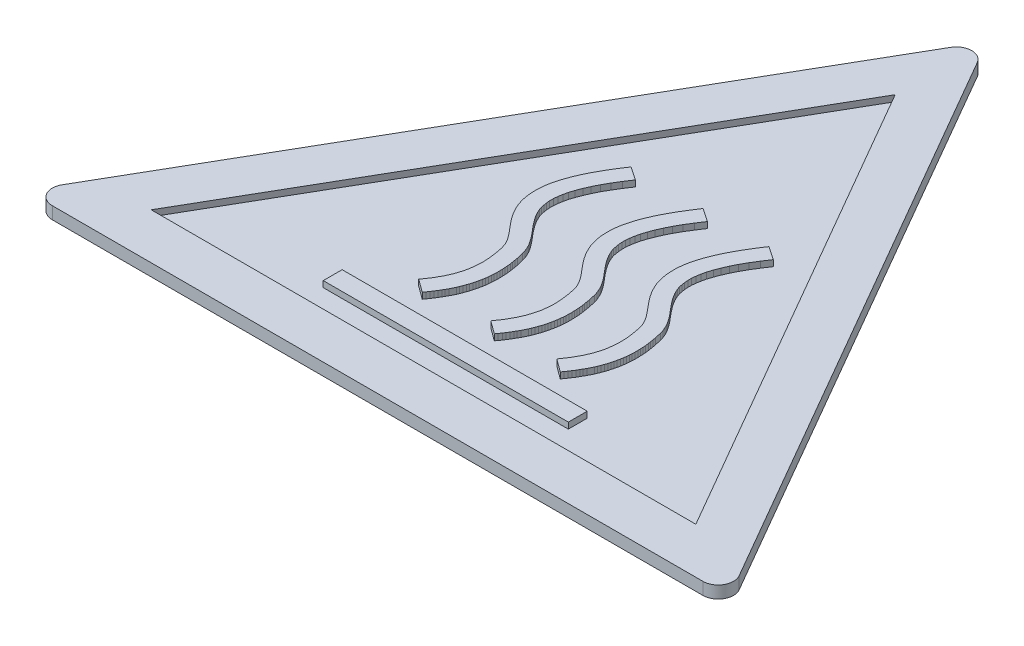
from build123d import *

# Parameters (mm, degrees)
SKIZZE1_W                       = 25
SKIZZE1_H                       = 25
LINEAR_AUSTRAGEN1_DEPTH         = 0.2
LINEAR_AUSTRAGEN_D_NN1_DEPTH    = 0.2
VERRUNDUNG1_R                   = 0.5
SKIZZE3_W                       = 8.01141993
SKIZZE3_H                       = 0.617561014
LINEAR_AUSTRAGEN2_DEPTH         = 0.2
SKIZZE4_OUTSIDE_W               = 34.072
SKIZZE4_OUTSIDE_H               = 34.072
SCHNITT_LINEAR_AUSTRAGEN1_DEPTH = 20.52972094


with BuildPart() as part:
    # Skizze1 → Linear austragen1 (new body)
    with BuildSketch(Plane(origin=(0, 0, 0), x_dir=(1, 0, 0), z_dir=(0, 1, 0))):
        with Locations((0, 2.5)):
            Rectangle(SKIZZE1_W, SKIZZE1_H)
    extrude(amount=LINEAR_AUSTRAGEN1_DEPTH)

    # Skizze2 → Linear-Austragen-D_nn1 (add)
    with BuildSketch(Plane(origin=(0, 0.2, 0), x_dir=(-1, 0, 0), z_dir=(0, 1, 0))):
        Polygon((11.5, 6.639528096), (0, -13.279056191), (-11.5, 6.639528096), align=None)
        Polygon((8.901923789, 5.139528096), (0, -10.279056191), (-8.901923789, 5.139528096), align=None, mode=Mode.SUBTRACT)
    extrude(amount=LINEAR_AUSTRAGEN_D_NN1_DEPTH)

    # Verrundung1
    verrundung1_edges = [part.edges().sort_by_distance(p)[0] for p in [
        (11.5, 0.3, 6.639528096),
        (0, 0.3, -13.279056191),
        (-11.5, 0.3, 6.639528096),
    ]]
    fillet(verrundung1_edges, radius=VERRUNDUNG1_R)

    # Skizze3 → Linear austragen2 (add)
    with BuildSketch(Plane(origin=(-0.935206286, 0.2, 1.03383953), x_dir=(1, 0, 0), z_dir=(0, 1, 0))):
        Polygon((-0.660127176, 0.718584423), (-0.69387368, 0.836697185), (-0.741118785, 0.948060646), (-0.79173854, 1.052674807), (-0.852482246, 1.150539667), (-0.916600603, 1.245029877), (-0.98409361, 1.336145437), (-1.051586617, 1.420511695), (-1.122454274, 1.504877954), (-1.189947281, 1.585869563), (-1.260814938, 1.670235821), (-1.321558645, 1.747852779), (-1.385677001, 1.832219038), (-1.443046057, 1.909835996), (-1.497040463, 1.994202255), (-1.547660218, 2.078568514), (-1.591530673, 2.166309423), (-1.632026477, 2.257424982), (-1.66239833, 2.345165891), (-1.682646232, 2.446405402), (-1.699519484, 2.551019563), (-1.709643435, 2.665757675), (-1.709643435, 2.787245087), (-1.696144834, 2.9154818), (-1.672522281, 3.057217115), (-1.638775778, 3.209076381), (-1.584781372, 3.374434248), (-1.517288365, 3.553290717), (-1.432922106, 3.745645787), (-1.331682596, 3.951499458), (-1.210195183, 4.16747708), (-1.065085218, 4.403702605), (-0.899727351, 4.653426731), (-1.338431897, 4.950395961), (-1.510539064, 4.687173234), (-1.66239833, 4.437449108), (-1.797384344, 4.194474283), (-1.912122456, 3.96837271), (-2.003238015, 3.755769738), (-2.084229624, 3.549916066), (-2.14497333, 3.350811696), (-2.192218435, 3.165205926), (-2.222590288, 2.982974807), (-2.23608889, 2.807492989), (-2.23608889, 2.645509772), (-2.225964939, 2.490275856), (-2.202342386, 2.345165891), (-2.168595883, 2.203430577), (-2.124725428, 2.068444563), (-2.070731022, 1.9435825), (-2.013361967, 1.828844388), (-1.94924361, 1.717480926), (-1.881750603, 1.612866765), (-1.810882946, 1.515001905), (-1.740015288, 1.423886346), (-1.66577298, 1.332770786), (-1.594905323, 1.248404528), (-1.527412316, 1.167412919), (-1.463293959, 1.089795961), (-1.402550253, 1.012179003), (-1.348555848, 0.941311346), (-1.297936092, 0.867069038), (-1.257440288, 0.796201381), (-1.220319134, 0.725333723), (-1.193321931, 0.661215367), (-1.173074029, 0.590347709), (-1.149451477, 0.5026068), (-1.132578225, 0.414865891), (-1.115704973, 0.330499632), (-1.102206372, 0.246133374), (-1.092082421, 0.165141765), (-1.08195847, 0.087524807), (-1.075209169, 0.009907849), (-1.071834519, -0.067709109), (-1.068459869, -0.148700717), (-1.068459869, -0.216193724), (-1.071834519, -0.287061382), (-1.07858382, -0.361303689), (-1.08533312, -0.435545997), (-1.095457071, -0.506413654), (-1.102206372, -0.570532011), (-1.115704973, -0.634650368), (-1.132578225, -0.702143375), (-1.149451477, -0.769636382), (-1.169699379, -0.833754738), (-1.193321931, -0.904622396), (-1.213569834, -0.972115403), (-1.240567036, -1.029484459), (-1.27093889, -1.096977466), (-1.297936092, -1.164470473), (-1.331682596, -1.225214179), (-1.36880375, -1.289332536), (-1.409299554, -1.363574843), (-1.446420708, -1.43106785), (-1.486916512, -1.491811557), (-1.534161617, -1.559304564), (-1.581406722, -1.630172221), (-1.628651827, -1.697665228), (-1.203445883, -2.00813306), (-1.149451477, -1.933890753), (-1.095457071, -1.856273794), (-1.048211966, -1.782031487), (-0.994217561, -1.701039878), (-0.950347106, -1.62004827), (-0.909851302, -1.552555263), (-0.865980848, -1.474938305), (-0.825485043, -1.393946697), (-0.784989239, -1.312955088), (-0.754617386, -1.23871278), (-0.720870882, -1.154346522), (-0.69387368, -1.073354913), (-0.663501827, -0.995737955), (-0.643253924, -0.911371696), (-0.619631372, -0.830380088), (-0.60275812, -0.74938848), (-0.582510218, -0.65827292), (-0.569011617, -0.573906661), (-0.558887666, -0.489540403), (-0.552138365, -0.401799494), (-0.545389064, -0.320807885), (-0.542014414, -0.229692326), (-0.542014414, -0.135202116), (-0.545389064, -0.047461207), (-0.548763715, 0.043654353), (-0.555513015, 0.134769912), (-0.565636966, 0.232634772), (-0.582510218, 0.327124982), (-0.59600882, 0.418240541), (-0.612882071, 0.516105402), (-0.636504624, 0.617344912), align=None)
        Polygon((1.695378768, 0.718584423), (1.661632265, 0.836697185), (1.61438716, 0.948060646), (1.563767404, 1.052674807), (1.503023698, 1.150539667), (1.438905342, 1.245029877), (1.371412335, 1.336145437), (1.303919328, 1.420511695), (1.23305167, 1.504877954), (1.165558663, 1.585869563), (1.094691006, 1.670235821), (1.0339473, 1.747852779), (0.969828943, 1.832219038), (0.912459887, 1.909835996), (0.858465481, 1.994202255), (0.807845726, 2.078568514), (0.763975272, 2.166309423), (0.723479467, 2.257424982), (0.693107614, 2.345165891), (0.672859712, 2.446405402), (0.65598646, 2.551019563), (0.645862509, 2.665757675), (0.645862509, 2.787245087), (0.659361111, 2.9154818), (0.682983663, 3.057217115), (0.716730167, 3.209076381), (0.770724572, 3.374434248), (0.838217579, 3.553290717), (0.922583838, 3.745645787), (1.023823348, 3.951499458), (1.145310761, 4.16747708), (1.290420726, 4.403702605), (1.455778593, 4.653426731), (1.017074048, 4.950395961), (0.84496688, 4.687173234), (0.693107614, 4.437449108), (0.5581216, 4.194474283), (0.443383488, 3.96837271), (0.352267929, 3.755769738), (0.27127632, 3.549916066), (0.210532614, 3.350811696), (0.163287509, 3.165205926), (0.132915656, 2.982974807), (0.119417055, 2.807492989), (0.119417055, 2.645509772), (0.129541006, 2.490275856), (0.153163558, 2.345165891), (0.186910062, 2.203430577), (0.230780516, 2.068444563), (0.284774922, 1.9435825), (0.342143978, 1.828844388), (0.406262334, 1.717480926), (0.473755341, 1.612866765), (0.544622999, 1.515001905), (0.615490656, 1.423886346), (0.689732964, 1.332770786), (0.760600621, 1.248404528), (0.828093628, 1.167412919), (0.892211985, 1.089795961), (0.952955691, 1.012179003), (1.006950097, 0.941311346), (1.057569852, 0.867069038), (1.098065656, 0.796201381), (1.13518681, 0.725333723), (1.162184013, 0.661215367), (1.182431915, 0.590347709), (1.206054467, 0.5026068), (1.222927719, 0.414865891), (1.239800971, 0.330499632), (1.253299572, 0.246133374), (1.263423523, 0.165141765), (1.273547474, 0.087524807), (1.280296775, 0.009907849), (1.283671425, -0.067709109), (1.287046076, -0.148700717), (1.287046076, -0.216193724), (1.283671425, -0.287061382), (1.276922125, -0.361303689), (1.270172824, -0.435545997), (1.260048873, -0.506413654), (1.253299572, -0.570532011), (1.239800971, -0.634650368), (1.222927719, -0.702143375), (1.206054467, -0.769636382), (1.185806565, -0.833754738), (1.162184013, -0.904622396), (1.141936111, -0.972115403), (1.114938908, -1.029484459), (1.084567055, -1.096977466), (1.057569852, -1.164470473), (1.023823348, -1.225214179), (0.986702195, -1.289332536), (0.94620639, -1.363574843), (0.909085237, -1.43106785), (0.868589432, -1.491811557), (0.821344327, -1.559304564), (0.774099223, -1.630172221), (0.726854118, -1.697665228), (1.152060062, -2.00813306), (1.206054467, -1.933890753), (1.260048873, -1.856273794), (1.307293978, -1.782031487), (1.361288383, -1.701039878), (1.405158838, -1.62004827), (1.445654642, -1.552555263), (1.489525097, -1.474938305), (1.530020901, -1.393946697), (1.570516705, -1.312955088), (1.600888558, -1.23871278), (1.634635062, -1.154346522), (1.661632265, -1.073354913), (1.692004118, -0.995737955), (1.71225202, -0.911371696), (1.735874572, -0.830380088), (1.752747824, -0.74938848), (1.772995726, -0.65827292), (1.786494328, -0.573906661), (1.796618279, -0.489540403), (1.803367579, -0.401799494), (1.81011688, -0.320807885), (1.81349153, -0.229692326), (1.81349153, -0.135202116), (1.81011688, -0.047461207), (1.80674223, 0.043654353), (1.799992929, 0.134769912), (1.789868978, 0.232634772), (1.772995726, 0.327124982), (1.759497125, 0.418240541), (1.742623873, 0.516105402), (1.719001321, 0.617344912), align=None)
        Polygon((3.851780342, 0.718584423), (3.818033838, 0.836697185), (3.770788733, 0.948060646), (3.720168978, 1.052674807), (3.659425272, 1.150539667), (3.595306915, 1.245029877), (3.527813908, 1.336145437), (3.460320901, 1.420511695), (3.389453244, 1.504877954), (3.321960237, 1.585869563), (3.251092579, 1.670235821), (3.190348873, 1.747852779), (3.126230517, 1.832219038), (3.068861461, 1.909835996), (3.014867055, 1.994202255), (2.9642473, 2.078568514), (2.920376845, 2.166309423), (2.879881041, 2.257424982), (2.849509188, 2.345165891), (2.829261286, 2.446405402), (2.812388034, 2.551019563), (2.802264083, 2.665757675), (2.802264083, 2.787245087), (2.815762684, 2.9154818), (2.839385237, 3.057217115), (2.87313174, 3.209076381), (2.927126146, 3.374434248), (2.994619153, 3.553290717), (3.078985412, 3.745645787), (3.180224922, 3.951499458), (3.301712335, 4.16747708), (3.4468223, 4.403702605), (3.612180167, 4.653426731), (3.173475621, 4.950395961), (3.001368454, 4.687173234), (2.849509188, 4.437449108), (2.714523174, 4.194474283), (2.599785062, 3.96837271), (2.508669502, 3.755769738), (2.427677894, 3.549916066), (2.366934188, 3.350811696), (2.319689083, 3.165205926), (2.28931723, 2.982974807), (2.275818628, 2.807492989), (2.275818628, 2.645509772), (2.285942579, 2.490275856), (2.309565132, 2.345165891), (2.343311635, 2.203430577), (2.38718209, 2.068444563), (2.441176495, 1.9435825), (2.498545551, 1.828844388), (2.562663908, 1.717480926), (2.630156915, 1.612866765), (2.701024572, 1.515001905), (2.77189223, 1.423886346), (2.846134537, 1.332770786), (2.917002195, 1.248404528), (2.984495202, 1.167412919), (3.048613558, 1.089795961), (3.109357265, 1.012179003), (3.16335167, 0.941311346), (3.213971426, 0.867069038), (3.25446723, 0.796201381), (3.291588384, 0.725333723), (3.318585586, 0.661215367), (3.338833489, 0.590347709), (3.362456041, 0.5026068), (3.379329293, 0.414865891), (3.396202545, 0.330499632), (3.409701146, 0.246133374), (3.419825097, 0.165141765), (3.429949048, 0.087524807), (3.436698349, 0.009907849), (3.440072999, -0.067709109), (3.443447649, -0.148700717), (3.443447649, -0.216193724), (3.440072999, -0.287061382), (3.433323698, -0.361303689), (3.426574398, -0.435545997), (3.416450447, -0.506413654), (3.409701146, -0.570532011), (3.396202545, -0.634650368), (3.379329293, -0.702143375), (3.362456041, -0.769636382), (3.342208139, -0.833754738), (3.318585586, -0.904622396), (3.298337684, -0.972115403), (3.271340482, -1.029484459), (3.240968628, -1.096977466), (3.213971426, -1.164470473), (3.180224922, -1.225214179), (3.143103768, -1.289332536), (3.102607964, -1.363574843), (3.06548681, -1.43106785), (3.024991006, -1.491811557), (2.977745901, -1.559304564), (2.930500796, -1.630172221), (2.883255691, -1.697665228), (3.308461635, -2.00813306), (3.362456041, -1.933890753), (3.416450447, -1.856273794), (3.463695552, -1.782031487), (3.517689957, -1.701039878), (3.561560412, -1.62004827), (3.602056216, -1.552555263), (3.64592667, -1.474938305), (3.686422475, -1.393946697), (3.726918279, -1.312955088), (3.757290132, -1.23871278), (3.791036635, -1.154346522), (3.818033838, -1.073354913), (3.848405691, -0.995737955), (3.868653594, -0.911371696), (3.892276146, -0.830380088), (3.909149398, -0.74938848), (3.9293973, -0.65827292), (3.942895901, -0.573906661), (3.953019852, -0.489540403), (3.959769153, -0.401799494), (3.966518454, -0.320807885), (3.969893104, -0.229692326), (3.969893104, -0.135202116), (3.966518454, -0.047461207), (3.963143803, 0.043654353), (3.956394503, 0.134769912), (3.946270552, 0.232634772), (3.9293973, 0.327124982), (3.915898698, 0.418240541), (3.899025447, 0.516105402), (3.875402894, 0.617344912), align=None)
        with Locations((0.855090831, -2.988468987)):
            Rectangle(SKIZZE3_W, SKIZZE3_H)
    extrude(amount=LINEAR_AUSTRAGEN2_DEPTH)

    # Skizze4 outside → Schnitt-Linear austragen1 (cut, through all)
    with BuildSketch(Plane(origin=(0, 0.4, 0), x_dir=(-1, 0, 0), z_dir=(0, 1, 0))):
        with Locations((0, -2.5)):
            Rectangle(SKIZZE4_OUTSIDE_W, SKIZZE4_OUTSIDE_H)
        with BuildLine():
            Line((-11.066987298, 5.889528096), (-0.433012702, -12.529056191))
            ThreePointArc((-0.433012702, -12.529056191), (0, -12.779056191), (0.433012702, -12.529056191))
            Line((0.433012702, -12.529056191), (11.066987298, 5.889528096))
            ThreePointArc((11.066987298, 5.889528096), (11.066987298, 6.389528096), (10.633974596, 6.639528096))
            Line((10.633974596, 6.639528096), (-10.633974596, 6.639528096))
            ThreePointArc((-10.633974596, 6.639528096), (-11.066987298, 6.389528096), (-11.066987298, 5.889528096))
        make_face(mode=Mode.SUBTRACT)
    extrude(amount=-SCHNITT_LINEAR_AUSTRAGEN1_DEPTH, mode=Mode.SUBTRACT)


solid = part.part
